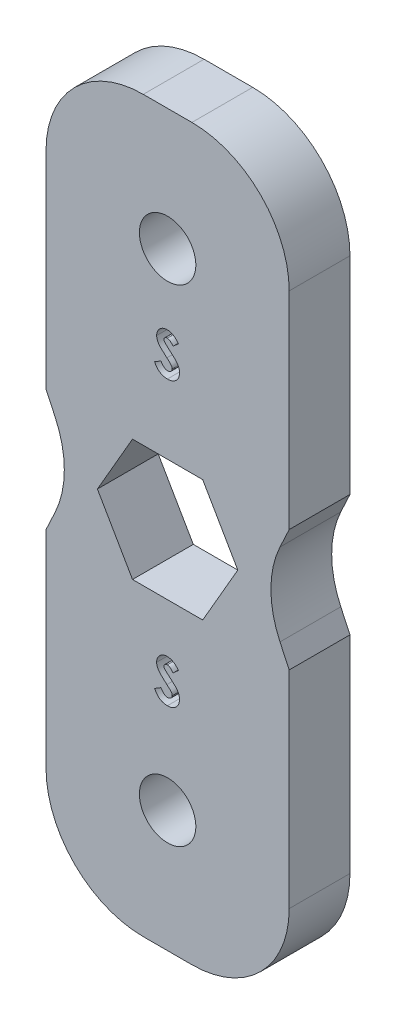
from build123d import *

# Parameters (mm, degrees)
BOSS_EXTRUDE1_DEPTH   = 3.175
FILLET1_R             = 5.08
F_4_CLEARANCE_HOLE1_D = 2.9464
CUT_EXTRUDE1_DEPTH    = 41.286233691


with BuildPart() as part:
    # Sketch1 → Boss-Extrude1 (new body)
    with BuildSketch(Plane.XY):
        Polygon((0, 38.1), (0, 22.225), (1.479928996, 19.05), (0, 15.875), (0, 0), (12.7, 0), (12.7, 15.875), (11.220071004, 19.05), (12.7, 22.225), (12.7, 38.1), align=None)
        Polygon((8.183087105, 22.225), (4.516912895, 22.225), (2.683825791, 19.05), (4.516912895, 15.875), (8.183087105, 15.875), (10.016174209, 19.05), align=None, mode=Mode.SUBTRACT)
    extrude(amount=BOSS_EXTRUDE1_DEPTH)

    # Fillet1
    fillet1_edges = [part.edges().sort_by_distance(p)[0] for p in [
        (1.479928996, 19.05, 1.5875),
        (0, 38.1, 1.5875),
        (12.7, 38.1, 1.5875),
        (11.220071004, 19.05, 1.5875),
        (12.7, 0, 1.5875),
        (0, 0, 1.5875),
    ]]
    fillet(fillet1_edges, radius=FILLET1_R)

    # 4 Clearance Hole1 (through all)
    with Locations(Plane(origin=(0, 0, 0), x_dir=(-1, 0, 0), z_dir=(0, 0, -1))):
        with Locations((-6.35, 6.35), (-6.35, 31.75)):
            Hole(F_4_CLEARANCE_HOLE1_D / 2)

    # Sketch4 → Cut-Extrude1 (cut, through all)
    with BuildSketch(Plane.XY.offset(3.175)):
        with BuildLine():
            Line((6.917700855, 27.740176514), (6.633612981, 27.48025731))
            add(Edge.make_bspline(
                [(6.633612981, 27.48025731), (6.621443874, 27.497423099), (6.598080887, 27.530379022), (6.560211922, 27.574507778), (6.522513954, 27.612152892), (6.484637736, 27.643157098), (6.446247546, 27.667332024), (6.407410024, 27.684448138), (6.368345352, 27.695329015), (6.342099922, 27.696683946), (6.329172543, 27.697351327)],
                knots=[0, 0, 0, 0, 1.299362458, 2.494594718, 3.587462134, 4.587049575, 5.512617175, 6.380583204, 7.202344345, 8, 8, 8, 8], degree=3))
            add(Edge.make_bspline(
                [(6.329172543, 27.697351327), (6.317114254, 27.696928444), (6.293832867, 27.696111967), (6.260643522, 27.68799625), (6.231177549, 27.673989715), (6.205463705, 27.655674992), (6.185094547, 27.633609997), (6.168831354, 27.610469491), (6.159673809, 27.584927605), (6.158468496, 27.567384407), (6.157871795, 27.558699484)],
                knots=[0, 0, 0, 0, 1.185010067, 2.2879431, 3.333075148, 4.379039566, 5.372662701, 6.27520591, 7.14612461, 8, 8, 8, 8], degree=3))
            add(Edge.make_bspline(
                [(6.157871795, 27.558699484), (6.158245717, 27.54988932), (6.158998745, 27.532146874), (6.166271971, 27.50614311), (6.177234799, 27.480734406), (6.187710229, 27.465266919), (6.19306477, 27.457360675)],
                knots=[0, 0, 0, 0, 0.967525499, 1.948461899, 2.951351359, 4, 4, 4, 4], degree=3))
            add(Edge.make_bspline(
                [(6.19306477, 27.457360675), (6.197932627, 27.451215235), (6.209137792, 27.437069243), (6.230503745, 27.414664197), (6.257334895, 27.387216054), (6.290663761, 27.355668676), (6.329106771, 27.318887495), (6.374445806, 27.278318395), (6.425375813, 27.232704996), (6.461575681, 27.200941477), (6.480544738, 27.184297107)],
                knots=[0, 0, 0, 0, 0.473873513, 1.090794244, 1.870441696, 2.795289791, 3.865433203, 5.087734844, 6.473946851, 8, 8, 8, 8], degree=3))
            add(Edge.make_bspline(
                [(6.480544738, 27.184297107), (6.498349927, 27.168887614), (6.532140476, 27.139643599), (6.580217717, 27.098136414), (6.622469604, 27.060793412), (6.659511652, 27.028175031), (6.690782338, 26.99993903), (6.716413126, 26.975950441), (6.736717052, 26.956676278), (6.748258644, 26.945034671), (6.753184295, 26.940066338)],
                knots=[0, 0, 0, 0, 1.543621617, 2.929473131, 4.163658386, 5.240097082, 6.164993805, 6.925417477, 7.541396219, 8, 8, 8, 8], degree=3))
            add(Edge.make_bspline(
                [(6.753184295, 26.940066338), (6.771871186, 26.919843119), (6.807793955, 26.88096699), (6.85448089, 26.820721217), (6.892905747, 26.761909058), (6.922631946, 26.703423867), (6.945082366, 26.644421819), (6.96091021, 26.583455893), (6.970389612, 26.519889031), (6.971442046, 26.476512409), (6.971974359, 26.454572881)],
                knots=[0, 0, 0, 0, 1.206664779, 2.319633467, 3.337109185, 4.282041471, 5.190008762, 6.099243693, 7.03861361, 8, 8, 8, 8], degree=3))
            add(Edge.make_bspline(
                [(6.971974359, 26.454572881), (6.971595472, 26.433195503), (6.970852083, 26.39125229), (6.961746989, 26.329874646), (6.948763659, 26.271133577), (6.928689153, 26.215668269), (6.904222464, 26.162568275), (6.873549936, 26.112660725), (6.837529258, 26.065440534), (6.796244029, 26.02175182), (6.750577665, 25.982107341), (6.701596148, 25.946814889), (6.648820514, 25.917676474), (6.59270167, 25.893683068), (6.533269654, 25.875203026), (6.470595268, 25.861544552), (6.404582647, 25.853346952), (6.359442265, 25.85248999), (6.336380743, 25.852052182)],
                knots=[0, 0, 0, 0, 1.043214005, 2.046824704, 3.02475056, 3.976699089, 4.921714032, 5.875962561, 6.831408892, 7.817874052, 8.806269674, 9.781291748, 10.760897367, 11.74438705, 12.757449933, 13.795994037, 14.874007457, 16, 16, 16, 16], degree=3))
            add(Edge.make_bspline(
                [(6.336380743, 25.852052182), (6.318277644, 25.852373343), (6.282423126, 25.853009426), (6.229578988, 25.858202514), (6.178551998, 25.866583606), (6.129399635, 25.878596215), (6.081900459, 25.89381782), (6.036052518, 25.912410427), (5.992172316, 25.934662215), (5.949927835, 25.960115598), (5.909524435, 25.989670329), (5.870451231, 26.022722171), (5.833096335, 26.059779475), (5.797280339, 26.100754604), (5.763232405, 26.145763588), (5.72983802, 26.194179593), (5.698581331, 26.246901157), (5.679272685, 26.28388576), (5.669410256, 26.302776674)],
                knots=[0, 0, 0, 0, 1.016823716, 2.013894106, 2.979844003, 3.91962641, 4.853723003, 5.779685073, 6.695824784, 7.614987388, 8.547259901, 9.504950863, 10.487499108, 11.500346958, 12.559593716, 13.656357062, 14.802919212, 16, 16, 16, 16], degree=3))
            Line((5.669410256, 26.302776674), (6.003531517, 26.503334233))
            add(Edge.make_bspline(
                [(6.003531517, 26.503334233), (6.015867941, 26.481890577), (6.039517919, 26.440781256), (6.079595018, 26.385545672), (6.12065196, 26.338245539), (6.163637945, 26.299716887), (6.208030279, 26.26944454), (6.254043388, 26.247809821), (6.301709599, 26.234417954), (6.334177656, 26.232782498), (6.35037313, 26.231966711)],
                knots=[0, 0, 0, 0, 1.283663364, 2.460892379, 3.537111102, 4.529833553, 5.449777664, 6.316464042, 7.160231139, 8, 8, 8, 8], degree=3))
            add(Edge.make_bspline(
                [(6.35037313, 26.231966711), (6.366846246, 26.232632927), (6.398806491, 26.233925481), (6.44442565, 26.245864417), (6.486251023, 26.264609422), (6.522404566, 26.291355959), (6.553017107, 26.322225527), (6.575610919, 26.356569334), (6.589804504, 26.393728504), (6.59130511, 26.419541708), (6.592059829, 26.43252427)],
                knots=[0, 0, 0, 0, 1.13588714, 2.203786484, 3.234766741, 4.283437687, 5.291419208, 6.222934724, 7.106237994, 8, 8, 8, 8], degree=3))
            add(Edge.make_bspline(
                [(6.592059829, 26.43252427), (6.591362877, 26.444602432), (6.589947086, 26.469138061), (6.579518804, 26.505618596), (6.563216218, 26.54208254), (6.54392911, 26.571991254), (6.524302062, 26.597033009), (6.505534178, 26.618730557), (6.482679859, 26.64270255), (6.455797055, 26.668979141), (6.425240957, 26.69779165), (6.390985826, 26.729137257), (6.352639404, 26.762739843), (6.325536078, 26.785629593), (6.311364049, 26.797598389)],
                knots=[0, 0, 0, 0, 0.916159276, 1.861089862, 2.860218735, 3.940849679, 4.552606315, 5.27541173, 6.11797699, 7.06649574, 8.129236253, 9.306560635, 10.591630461, 12, 12, 12, 12], degree=3))
            add(Edge.make_bspline(
                [(6.311364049, 26.797598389), (6.284422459, 26.820393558), (6.232713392, 26.864144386), (6.159641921, 26.928762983), (6.093797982, 26.989154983), (6.035750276, 27.046066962), (5.984759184, 27.09844789), (5.94117004, 27.146723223), (5.90546169, 27.191265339), (5.867886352, 27.244022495), (5.832182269, 27.308310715), (5.801323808, 27.385656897), (5.781304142, 27.462993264), (5.779061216, 27.514912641), (5.777957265, 27.540466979)],
                knots=[0, 0, 0, 0, 1.345494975, 2.582412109, 3.71882943, 4.751509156, 5.681369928, 6.505683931, 7.230279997, 7.856715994, 8.973648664, 10.023341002, 11.027102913, 12, 12, 12, 12], degree=3))
            add(Edge.make_bspline(
                [(5.777957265, 27.540466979), (5.778416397, 27.558588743), (5.779320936, 27.594290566), (5.787389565, 27.646784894), (5.799448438, 27.69743751), (5.816961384, 27.74606361), (5.839691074, 27.792602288), (5.867295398, 27.83728137), (5.900203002, 27.87968964), (5.937287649, 27.919798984), (5.978145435, 27.956454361), (6.021807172, 27.988806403), (6.068025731, 28.016131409), (6.116518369, 28.038799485), (6.167585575, 28.056150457), (6.22085114, 28.068449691), (6.276391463, 28.075764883), (6.314168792, 28.076759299), (6.33341266, 28.077265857)],
                knots=[0, 0, 0, 0, 1.010766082, 1.991317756, 2.957454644, 3.913069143, 4.869106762, 5.843196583, 6.838735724, 7.860187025, 8.887984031, 9.89767229, 10.887916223, 11.879572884, 12.879850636, 13.892031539, 14.926195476, 16, 16, 16, 16], degree=3))
            add(Edge.make_bspline(
                [(6.33341266, 28.077265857), (6.358351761, 28.076353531), (6.408033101, 28.074536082), (6.481488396, 28.060324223), (6.553236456, 28.037974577), (6.611052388, 28.011012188), (6.657055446, 27.984893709), (6.692312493, 27.960847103), (6.728188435, 27.933300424), (6.764972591, 27.902166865), (6.801981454, 27.866859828), (6.840267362, 27.828219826), (6.879308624, 27.785912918), (6.904679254, 27.755689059), (6.917700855, 27.740176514)],
                knots=[0, 0, 0, 0, 1.282922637, 2.555718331, 3.837320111, 5.142675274, 5.830281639, 6.55870424, 7.337177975, 8.157850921, 9.037902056, 9.96903443, 10.957596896, 12, 12, 12, 12], degree=3))
        make_face()
        with BuildLine():
            Line((6.917700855, 12.962066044), (6.633612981, 12.70214684))
            add(Edge.make_bspline(
                [(6.633612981, 12.70214684), (6.621443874, 12.71931263), (6.598080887, 12.752268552), (6.560211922, 12.796397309), (6.522513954, 12.834042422), (6.484637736, 12.865046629), (6.446247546, 12.889221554), (6.407410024, 12.906337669), (6.368345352, 12.917218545), (6.342099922, 12.918573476), (6.329172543, 12.919240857)],
                knots=[0, 0, 0, 0, 1.299362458, 2.494594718, 3.587462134, 4.587049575, 5.512617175, 6.380583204, 7.202344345, 8, 8, 8, 8], degree=3))
            add(Edge.make_bspline(
                [(6.329172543, 12.919240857), (6.317114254, 12.918817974), (6.293832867, 12.918001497), (6.260643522, 12.909885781), (6.231177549, 12.895879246), (6.205463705, 12.877564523), (6.185094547, 12.855499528), (6.168831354, 12.832359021), (6.159673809, 12.806817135), (6.158468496, 12.789273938), (6.157871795, 12.780589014)],
                knots=[0, 0, 0, 0, 1.185010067, 2.2879431, 3.333075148, 4.379039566, 5.372662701, 6.27520591, 7.14612461, 8, 8, 8, 8], degree=3))
            add(Edge.make_bspline(
                [(6.157871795, 12.780589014), (6.158245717, 12.77177885), (6.158998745, 12.754036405), (6.166271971, 12.728032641), (6.177234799, 12.702623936), (6.187710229, 12.687156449), (6.19306477, 12.679250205)],
                knots=[0, 0, 0, 0, 0.967525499, 1.948461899, 2.951351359, 4, 4, 4, 4], degree=3))
            add(Edge.make_bspline(
                [(6.19306477, 12.679250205), (6.197932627, 12.673104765), (6.209137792, 12.658958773), (6.230503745, 12.636553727), (6.257334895, 12.609105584), (6.290663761, 12.577558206), (6.329106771, 12.540777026), (6.374445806, 12.500207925), (6.425375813, 12.454594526), (6.461575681, 12.422831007), (6.480544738, 12.406186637)],
                knots=[0, 0, 0, 0, 0.473873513, 1.090794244, 1.870441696, 2.795289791, 3.865433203, 5.087734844, 6.473946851, 8, 8, 8, 8], degree=3))
            add(Edge.make_bspline(
                [(6.480544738, 12.406186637), (6.498349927, 12.390777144), (6.532140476, 12.361533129), (6.580217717, 12.320025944), (6.622469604, 12.282682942), (6.659511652, 12.250064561), (6.690782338, 12.22182856), (6.716413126, 12.197839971), (6.736717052, 12.178565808), (6.748258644, 12.166924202), (6.753184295, 12.161955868)],
                knots=[0, 0, 0, 0, 1.543621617, 2.929473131, 4.163658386, 5.240097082, 6.164993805, 6.925417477, 7.541396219, 8, 8, 8, 8], degree=3))
            add(Edge.make_bspline(
                [(6.753184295, 12.161955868), (6.771871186, 12.141732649), (6.807793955, 12.10285652), (6.85448089, 12.042610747), (6.892905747, 11.983798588), (6.922631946, 11.925313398), (6.945082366, 11.86631135), (6.96091021, 11.805345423), (6.970389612, 11.741778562), (6.971442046, 11.698401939), (6.971974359, 11.676462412)],
                knots=[0, 0, 0, 0, 1.206664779, 2.319633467, 3.337109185, 4.282041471, 5.190008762, 6.099243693, 7.03861361, 8, 8, 8, 8], degree=3))
            add(Edge.make_bspline(
                [(6.971974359, 11.676462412), (6.971595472, 11.655085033), (6.970852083, 11.61314182), (6.961746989, 11.551764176), (6.948763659, 11.493023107), (6.928689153, 11.437557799), (6.904222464, 11.384457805), (6.873549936, 11.334550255), (6.837529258, 11.287330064), (6.796244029, 11.24364135), (6.750577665, 11.203996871), (6.701596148, 11.168704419), (6.648820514, 11.139566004), (6.59270167, 11.115572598), (6.533269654, 11.097092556), (6.470595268, 11.083434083), (6.404582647, 11.075236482), (6.359442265, 11.07437952), (6.336380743, 11.073941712)],
                knots=[0, 0, 0, 0, 1.043214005, 2.046824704, 3.02475056, 3.976699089, 4.921714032, 5.875962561, 6.831408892, 7.817874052, 8.806269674, 9.781291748, 10.760897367, 11.74438705, 12.757449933, 13.795994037, 14.874007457, 16, 16, 16, 16], degree=3))
            add(Edge.make_bspline(
                [(6.336380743, 11.073941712), (6.318277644, 11.074262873), (6.282423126, 11.074898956), (6.229578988, 11.080092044), (6.178551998, 11.088473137), (6.129399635, 11.100485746), (6.081900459, 11.11570735), (6.036052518, 11.134299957), (5.992172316, 11.156551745), (5.949927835, 11.182005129), (5.909524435, 11.21155986), (5.870451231, 11.244611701), (5.833096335, 11.281669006), (5.797280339, 11.322644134), (5.763232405, 11.367653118), (5.72983802, 11.416069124), (5.698581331, 11.468790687), (5.679272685, 11.50577529), (5.669410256, 11.524666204)],
                knots=[0, 0, 0, 0, 1.016823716, 2.013894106, 2.979844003, 3.91962641, 4.853723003, 5.779685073, 6.695824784, 7.614987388, 8.547259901, 9.504950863, 10.487499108, 11.500346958, 12.559593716, 13.656357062, 14.802919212, 16, 16, 16, 16], degree=3))
            Line((5.669410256, 11.524666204), (6.003531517, 11.725223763))
            add(Edge.make_bspline(
                [(6.003531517, 11.725223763), (6.015867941, 11.703780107), (6.039517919, 11.662670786), (6.079595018, 11.607435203), (6.12065196, 11.560135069), (6.163637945, 11.521606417), (6.208030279, 11.49133407), (6.254043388, 11.469699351), (6.301709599, 11.456307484), (6.334177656, 11.454672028), (6.35037313, 11.453856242)],
                knots=[0, 0, 0, 0, 1.283663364, 2.460892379, 3.537111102, 4.529833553, 5.449777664, 6.316464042, 7.160231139, 8, 8, 8, 8], degree=3))
            add(Edge.make_bspline(
                [(6.35037313, 11.453856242), (6.366846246, 11.454522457), (6.398806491, 11.455815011), (6.44442565, 11.467753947), (6.486251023, 11.486498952), (6.522404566, 11.513245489), (6.553017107, 11.544115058), (6.575610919, 11.578458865), (6.589804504, 11.615618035), (6.59130511, 11.641431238), (6.592059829, 11.654413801)],
                knots=[0, 0, 0, 0, 1.13588714, 2.203786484, 3.234766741, 4.283437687, 5.291419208, 6.222934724, 7.106237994, 8, 8, 8, 8], degree=3))
            add(Edge.make_bspline(
                [(6.592059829, 11.654413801), (6.591362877, 11.666491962), (6.589947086, 11.691027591), (6.579518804, 11.727508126), (6.563216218, 11.763972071), (6.54392911, 11.793880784), (6.524302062, 11.81892254), (6.505534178, 11.840620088), (6.482679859, 11.86459208), (6.455797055, 11.890868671), (6.425240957, 11.919681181), (6.390985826, 11.951026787), (6.352639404, 11.984629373), (6.325536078, 12.007519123), (6.311364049, 12.019487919)],
                knots=[0, 0, 0, 0, 0.916159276, 1.861089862, 2.860218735, 3.940849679, 4.552606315, 5.27541173, 6.11797699, 7.06649574, 8.129236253, 9.306560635, 10.591630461, 12, 12, 12, 12], degree=3))
            add(Edge.make_bspline(
                [(6.311364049, 12.019487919), (6.284422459, 12.042283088), (6.232713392, 12.086033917), (6.159641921, 12.150652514), (6.093797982, 12.211044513), (6.035750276, 12.267956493), (5.984759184, 12.32033742), (5.94117004, 12.368612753), (5.90546169, 12.413154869), (5.867886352, 12.465912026), (5.832182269, 12.530200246), (5.801323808, 12.607546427), (5.781304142, 12.684882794), (5.779061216, 12.736802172), (5.777957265, 12.762356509)],
                knots=[0, 0, 0, 0, 1.345494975, 2.582412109, 3.71882943, 4.751509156, 5.681369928, 6.505683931, 7.230279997, 7.856715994, 8.973648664, 10.023341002, 11.027102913, 12, 12, 12, 12], degree=3))
            add(Edge.make_bspline(
                [(5.777957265, 12.762356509), (5.778416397, 12.780478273), (5.779320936, 12.816180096), (5.787389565, 12.868674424), (5.799448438, 12.91932704), (5.816961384, 12.96795314), (5.839691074, 13.014491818), (5.867295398, 13.0591709), (5.900203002, 13.10157917), (5.937287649, 13.141688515), (5.978145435, 13.178343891), (6.021807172, 13.210695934), (6.068025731, 13.238020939), (6.116518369, 13.260689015), (6.167585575, 13.278039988), (6.22085114, 13.290339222), (6.276391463, 13.297654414), (6.314168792, 13.298648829), (6.33341266, 13.299155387)],
                knots=[0, 0, 0, 0, 1.010766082, 1.991317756, 2.957454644, 3.913069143, 4.869106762, 5.843196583, 6.838735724, 7.860187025, 8.887984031, 9.89767229, 10.887916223, 11.879572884, 12.879850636, 13.892031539, 14.926195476, 16, 16, 16, 16], degree=3))
            add(Edge.make_bspline(
                [(6.33341266, 13.299155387), (6.358351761, 13.298243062), (6.408033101, 13.296425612), (6.481488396, 13.282213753), (6.553236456, 13.259864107), (6.611052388, 13.232901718), (6.657055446, 13.206783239), (6.692312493, 13.182736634), (6.728188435, 13.155189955), (6.764972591, 13.124056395), (6.801981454, 13.088749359), (6.840267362, 13.050109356), (6.879308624, 13.007802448), (6.904679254, 12.977578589), (6.917700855, 12.962066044)],
                knots=[0, 0, 0, 0, 1.282922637, 2.555718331, 3.837320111, 5.142675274, 5.830281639, 6.55870424, 7.337177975, 8.157850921, 9.037902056, 9.96903443, 10.957596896, 12, 12, 12, 12], degree=3))
        make_face()
    extrude(amount=-CUT_EXTRUDE1_DEPTH, mode=Mode.SUBTRACT)


solid = part.part
